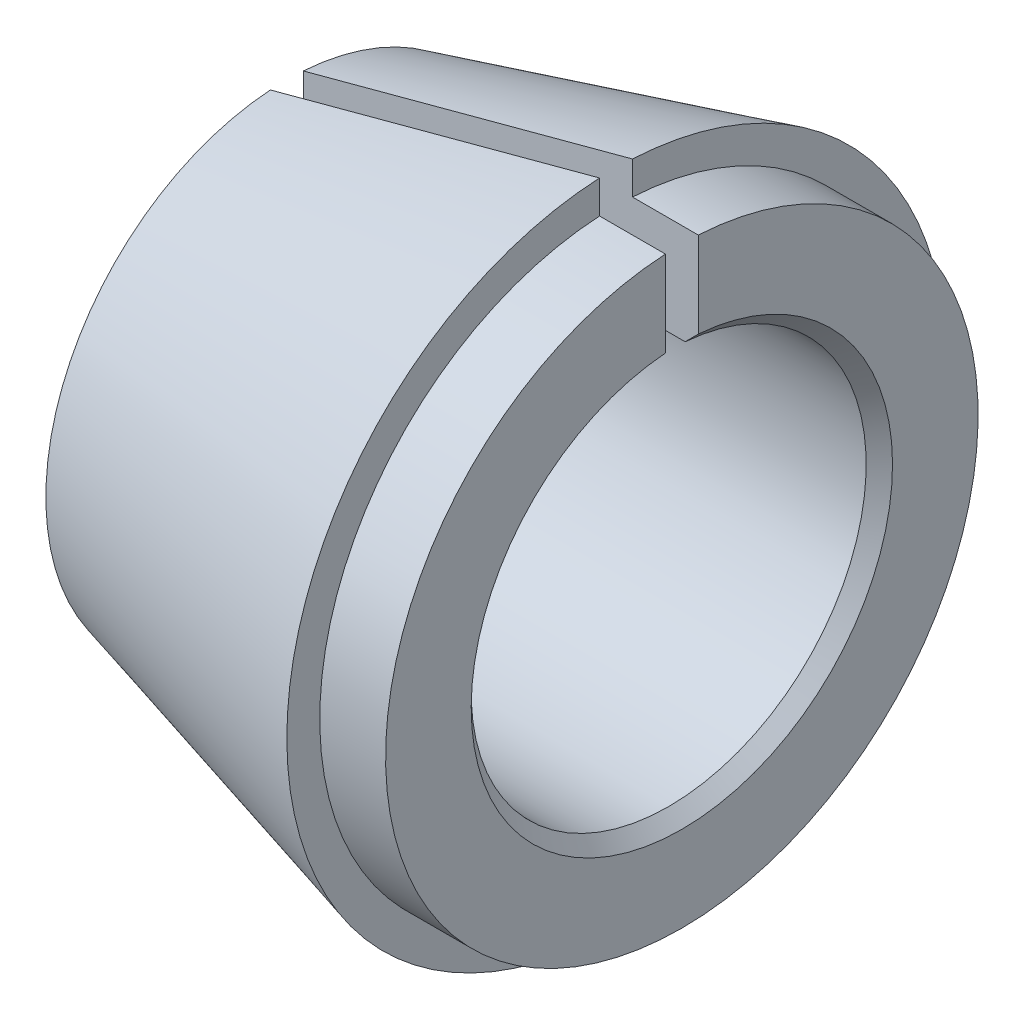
from build123d import *

# Parameters (mm, degrees)
SKETCH2_W          = 6
SKETCH2_H          = 0.5
CUT_EXTRUDE1_DEPTH = 10.273618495


with BuildPart() as part:
    # Sketch1 → Revolve1 (revolve)
    with BuildSketch(Plane.XY):
        Polygon((-5.8, 3), (-0.2, 3), (0, 3.2), (0, 4.5), (-1, 4.5), (-1, 5), (-6, 3.660254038), (-6, 3.2), align=None)
    revolve(axis=Axis((0, 0, 0), (-1, 0, 0)))

    # Sketch2 → Cut-Extrude1 (cut, through all)
    with BuildSketch(Plane(origin=(0, 0, 0), x_dir=(1, 0, 0), z_dir=(0, 1, 0))):
        with Locations((-3, 0)):
            Rectangle(SKETCH2_W, SKETCH2_H)
    extrude(amount=CUT_EXTRUDE1_DEPTH, mode=Mode.SUBTRACT)


solid = part.part
